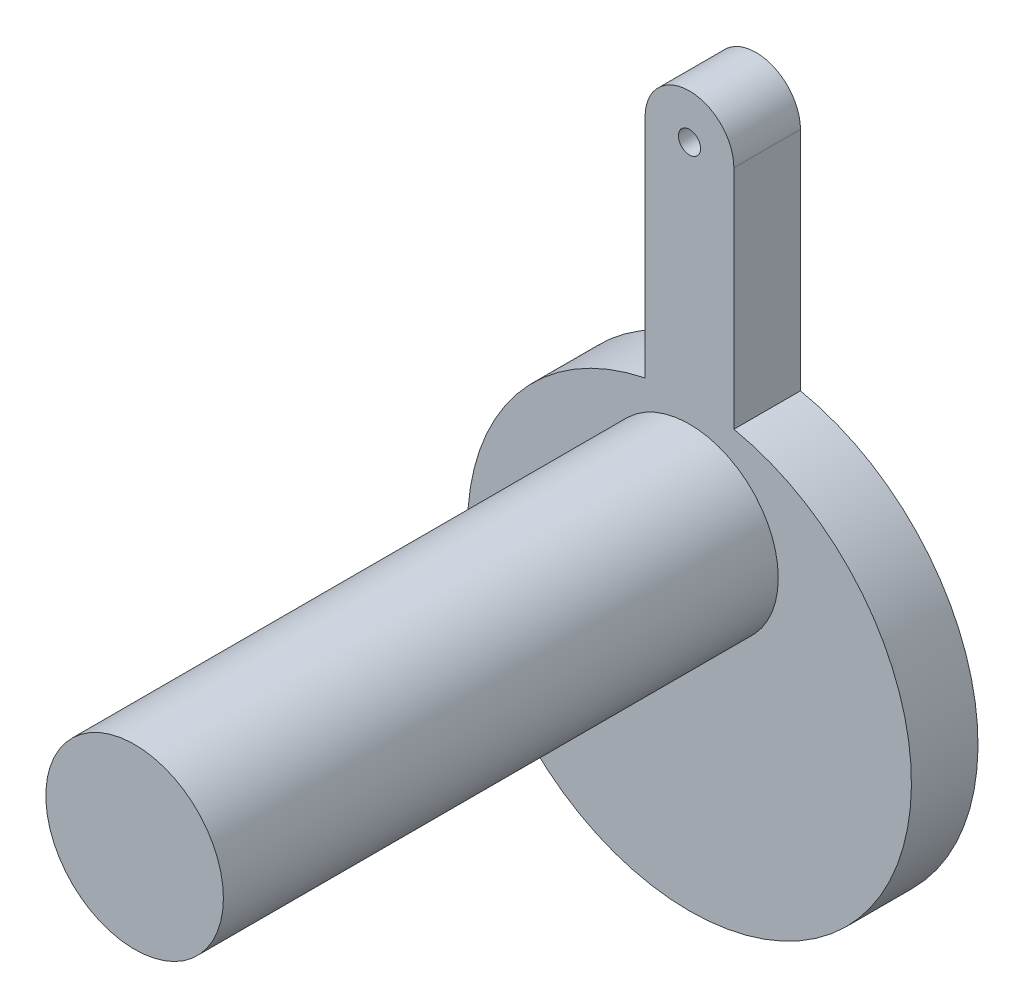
from build123d import *

# Parameters (mm, degrees)
Y_KSEKLIK_EKSTR_ZYON1_DEPTH      = 30
IZIM2_R                          = 5
IZIM2_R_2                        = 20
KES_EKSTR_ZYON1_DEPTH            = 30
IZIM3_R                          = 40
KES_EKSTR_ZYON3_DEPTH            = 40
Y_KSEKLIK_EKSTR_ZYON2_DEPTH      = 250
Y_KSEKLIK_EKSTR_ZYON2_DEPTH_BACK = 30
IZIM4_R                          = 40


with BuildPart() as part:
    # izim1 → Y_kseklik-Ekstr_zyon1 (new body)
    with BuildSketch(Plane.XY):
        with BuildLine():
            Line((-20, 55), (-20, -47.020410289))
            ThreePointArc((-20, -47.020410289), (0, -245), (20, -47.020410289))
            Line((20, -47.020410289), (20, 55))
            ThreePointArc((20, 55), (0, 75), (-20, 55))
        make_face()
    extrude(amount=Y_KSEKLIK_EKSTR_ZYON1_DEPTH)

    # izim2 → Kes-Ekstr_zyon1 (cut)
    with BuildSketch(Plane.XY.offset(30)):
        with Locations((0, 55)):
            Circle(IZIM2_R)
        with Locations((0, -95)):
            Circle(IZIM2_R_2)
    extrude(amount=-KES_EKSTR_ZYON1_DEPTH, mode=Mode.SUBTRACT)

    # izim3 → Kes-Ekstr_zyon3 (cut)
    with BuildSketch(Plane.XY.offset(30)):
        with Locations((0, -95)):
            Circle(IZIM3_R)
    extrude(amount=-KES_EKSTR_ZYON3_DEPTH, mode=Mode.SUBTRACT)

    # izim4 → Y_kseklik-Ekstr_zyon2 (add, two sides: drawn at the far end of the back side and taken through both)
    with BuildSketch(Plane.XY.offset(30).offset(-Y_KSEKLIK_EKSTR_ZYON2_DEPTH_BACK)):
        with Locations((0, -95)):
            Circle(IZIM4_R)
    extrude(amount=Y_KSEKLIK_EKSTR_ZYON2_DEPTH + Y_KSEKLIK_EKSTR_ZYON2_DEPTH_BACK)


solid = part.part
